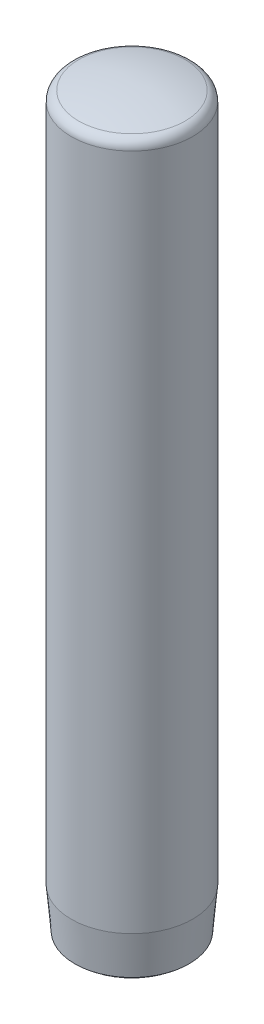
from build123d import *


with BuildPart() as part:
    # Esquisse1 → Base-R_volution (revolve)
    with BuildSketch(Plane.XY, mode=Mode.PRIVATE) as base_r_volution_sk:
        with BuildLine():
            Line((-2.825, 1), (-3, 3))
            Line((-3, 3), (-3, 36.5))
            ThreePointArc((-3, 36.5), (-2.897359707, 36.803488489), (-2.631578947, 36.982376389))
            ThreePointArc((-2.631578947, 36.982376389), (-1.327539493, 37.246338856), (0, 37.33484861))
            Line((0, 37.33484861), (0, 0))
            ThreePointArc((0, 0), (-1.505196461, 0.238132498), (-2.825, 1))
        make_face()
    revolve(base_r_volution_sk.sketch.rotate(Axis((0, 27.33484861, 0), (0, -1, 0)), 270), axis=Axis((0, 27.33484861, 0), (0, -1, 0)))


solid = part.part
